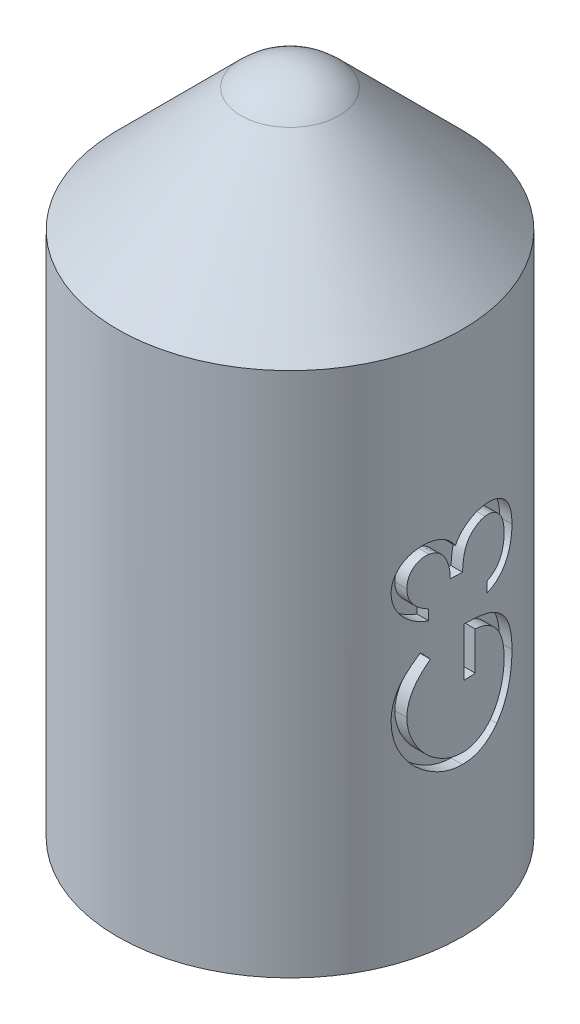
from build123d import *

# Parameters (mm, degrees)
ENL_V_MAT_EXTRU_1_REACH      = 8.874
ENL_V_MAT_EXTRU_1_END_RADIUS = 1.4
ENL_V_MAT_EXTRU_2_REACH      = 8.874
ENL_V_MAT_EXTRU_2_END_RADIUS = 1.4


with BuildPart() as part:
    # Esquisse1 → R_volution1 (revolve)
    with BuildSketch(Plane.XY):
        with BuildLine():
            Line((-1.5, 4.75), (-1.5, 0.17544468))
            ThreePointArc((-1.5, 0.17544468), (-0.755112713, 0.044010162), (0, 0))
            Line((0, 0), (0, 6))
            ThreePointArc((0, 6), (-0.230969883, 5.954057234), (-0.426776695, 5.823223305))
            Line((-0.426776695, 5.823223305), (-1.5, 4.75))
        make_face()
    revolve(axis=Axis((0, 0, 0), (0, 1, 0)))

    # Enl_v. mat.-Extru.1: up to this cylinder (the profile starts outside it)
    enl_v_mat_extru_1_end = Plane(origin=(0, 2.7231785, 0), z_dir=(0, -1, 0)) * Cylinder(ENL_V_MAT_EXTRU_1_END_RADIUS, 22.171931, mode=Mode.PRIVATE)
    # Esquisse2 → Enl_v. mat.-Extru.1 (cut, up to the surface)
    with BuildSketch(Plane(origin=(1.5, 0, 0), x_dir=(0, 0, -1), z_dir=(1, 0, 0)), mode=Mode.PRIVATE) as enl_v_mat_extru_1_sk1:
        with BuildLine():
            Line((-0.329326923, 2.459902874), (-0.256410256, 2.382979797))
            add(Edge.make_bspline(
                [(-0.256410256, 2.382979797), (-0.269509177, 2.369062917), (-0.295394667, 2.341561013), (-0.328926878, 2.296646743), (-0.357936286, 2.249973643), (-0.381363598, 2.201466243), (-0.399741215, 2.152396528), (-0.413100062, 2.103608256), (-0.421560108, 2.055417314), (-0.422576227, 2.02337037), (-0.423076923, 2.007579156)],
                knots=[0, 0, 0, 0, 1.089067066, 2.152164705, 3.18986567, 4.218445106, 5.218487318, 6.173592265, 7.100032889, 8, 8, 8, 8], degree=3))
            add(Edge.make_bspline(
                [(-0.423076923, 2.007579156), (-0.42295875, 1.997889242), (-0.42272271, 1.978534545), (-0.419710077, 1.949785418), (-0.415377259, 1.921337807), (-0.409108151, 1.893245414), (-0.401162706, 1.865453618), (-0.391224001, 1.838059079), (-0.379636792, 1.811010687), (-0.3662475, 1.784563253), (-0.351539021, 1.758923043), (-0.335239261, 1.734707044), (-0.317871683, 1.711759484), (-0.298997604, 1.690516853), (-0.278802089, 1.670837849), (-0.257648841, 1.652360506), (-0.235121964, 1.635429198), (-0.211314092, 1.620347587), (-0.186779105, 1.606728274), (-0.161725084, 1.594959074), (-0.136384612, 1.584727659), (-0.11056688, 1.576935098), (-0.084538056, 1.570334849), (-0.058161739, 1.56574021), (-0.031369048, 1.563141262), (-0.013426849, 1.56269255), (-0.004407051, 1.562466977)],
                knots=[0, 0, 0, 0, 1.028150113, 2.053633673, 3.06513288, 4.081487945, 5.106702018, 6.131327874, 7.172780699, 8.228344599, 9.276313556, 10.308389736, 11.324843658, 12.329040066, 13.321460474, 14.316307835, 15.308626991, 16.309440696, 17.305625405, 18.28535951, 19.246194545, 20.203493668, 21.145557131, 22.095268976, 23.042464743, 24, 24, 24, 24], degree=3))
            add(Edge.make_bspline(
                [(-0.004407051, 1.562466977), (0.004813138, 1.562683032), (0.023228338, 1.563114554), (0.050713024, 1.56587261), (0.077786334, 1.57100267), (0.104490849, 1.577806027), (0.130879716, 1.586455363), (0.156925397, 1.597081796), (0.18262536, 1.609740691), (0.207724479, 1.624361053), (0.232153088, 1.640506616), (0.255356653, 1.658264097), (0.277065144, 1.677663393), (0.297595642, 1.698348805), (0.316818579, 1.720508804), (0.334502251, 1.744358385), (0.350920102, 1.769563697), (0.365891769, 1.796135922), (0.379265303, 1.823794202), (0.391157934, 1.852153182), (0.400952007, 1.881304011), (0.408934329, 1.911093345), (0.415477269, 1.94148571), (0.41968655, 1.972635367), (0.422741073, 2.004313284), (0.422964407, 2.025667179), (0.423076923, 2.03642531)],
                knots=[0, 0, 0, 0, 0.935915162, 1.869274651, 2.799799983, 3.730201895, 4.664668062, 5.616159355, 6.583070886, 7.570012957, 8.562524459, 9.553461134, 10.53281078, 11.515274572, 12.509912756, 13.507571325, 14.526460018, 15.561318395, 16.601025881, 17.643204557, 18.680545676, 19.719612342, 20.772381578, 21.833430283, 22.908478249, 24, 24, 24, 24], degree=3))
            add(Edge.make_bspline(
                [(0.423076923, 2.03642531), (0.422806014, 2.049390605), (0.422274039, 2.074850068), (0.418129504, 2.112274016), (0.411664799, 2.148220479), (0.402167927, 2.182572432), (0.390147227, 2.215454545), (0.375281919, 2.246745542), (0.357728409, 2.276531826), (0.337842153, 2.304684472), (0.315685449, 2.330534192), (0.291989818, 2.3540605), (0.266448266, 2.374454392), (0.239441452, 2.392325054), (0.21071105, 2.407095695), (0.180416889, 2.419223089), (0.148540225, 2.428518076), (0.126514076, 2.432333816), (0.115384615, 2.434261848)],
                knots=[0, 0, 0, 0, 1.130199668, 2.219330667, 3.279027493, 4.311506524, 5.322739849, 6.327972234, 7.327472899, 8.33386792, 9.329086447, 10.29244429, 11.240784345, 12.174119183, 13.111530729, 14.052100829, 15.015757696, 16, 16, 16, 16], degree=3))
            Line((0.115384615, 2.434261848), (0.115384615, 2.100928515))
            Line((0.115384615, 2.100928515), (0.012820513, 2.100928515))
            Line((0.012820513, 2.100928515), (0.012820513, 2.524005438))
            add(Edge.make_bspline(
                [(0.012820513, 2.524005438), (0.031936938, 2.523518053), (0.069351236, 2.522564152), (0.12391417, 2.515873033), (0.17544894, 2.505068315), (0.224009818, 2.490308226), (0.269527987, 2.471201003), (0.312049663, 2.447951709), (0.351300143, 2.420188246), (0.387599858, 2.388899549), (0.419979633, 2.353785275), (0.448438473, 2.315794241), (0.472410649, 2.274863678), (0.491913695, 2.231032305), (0.507134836, 2.18444361), (0.517926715, 2.134989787), (0.524392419, 2.082737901), (0.525218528, 2.046927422), (0.525641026, 2.02861281)],
                knots=[0, 0, 0, 0, 1.140356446, 2.231883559, 3.274166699, 4.278491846, 5.25512956, 6.21435461, 7.1637429, 8.11826594, 9.068280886, 10.0076534, 10.945064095, 11.891975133, 12.864533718, 13.863980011, 14.907571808, 16, 16, 16, 16], degree=3))
            add(Edge.make_bspline(
                [(0.525641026, 2.02861281), (0.52547842, 2.0173242), (0.525157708, 1.995059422), (0.522878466, 1.9621763), (0.51936973, 1.930199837), (0.514071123, 1.899134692), (0.507581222, 1.868866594), (0.499270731, 1.839546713), (0.489651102, 1.811063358), (0.478709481, 1.783372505), (0.466031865, 1.756725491), (0.451943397, 1.731003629), (0.436516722, 1.706064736), (0.419485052, 1.682078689), (0.400975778, 1.658920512), (0.380951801, 1.636739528), (0.359474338, 1.615411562), (0.344223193, 1.60205143), (0.336538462, 1.595319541)],
                knots=[0, 0, 0, 0, 1.107784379, 2.184907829, 3.233506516, 4.263428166, 5.276301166, 6.270063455, 7.25232949, 8.225834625, 9.190232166, 10.146266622, 11.1027726, 12.066435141, 13.031522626, 14.010570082, 14.99756817, 16, 16, 16, 16], degree=3))
            add(Edge.make_bspline(
                [(0.336538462, 1.595319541), (0.324346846, 1.585552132), (0.300165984, 1.566179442), (0.261423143, 1.541242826), (0.221308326, 1.519985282), (0.179709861, 1.502737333), (0.136666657, 1.489269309), (0.092233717, 1.479610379), (0.046353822, 1.473951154), (0.015306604, 1.473135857), (-0.000400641, 1.472723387)],
                knots=[0, 0, 0, 0, 1.023165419, 2.029347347, 3.013907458, 3.994755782, 4.975994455, 5.96558838, 6.970761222, 8, 8, 8, 8], degree=3))
            add(Edge.make_bspline(
                [(-0.000400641, 1.472723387), (-0.012162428, 1.472875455), (-0.035536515, 1.473177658), (-0.070238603, 1.476842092), (-0.104324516, 1.482099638), (-0.137766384, 1.489827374), (-0.170586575, 1.499569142), (-0.202800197, 1.511727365), (-0.234426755, 1.52588273), (-0.265246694, 1.542336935), (-0.294858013, 1.560642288), (-0.323115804, 1.58053019), (-0.349562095, 1.6021541), (-0.374258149, 1.625576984), (-0.397569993, 1.650326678), (-0.419010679, 1.676922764), (-0.438915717, 1.704962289), (-0.456902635, 1.734662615), (-0.473064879, 1.765555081), (-0.487232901, 1.797572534), (-0.498942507, 1.830703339), (-0.508877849, 1.864699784), (-0.516225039, 1.899819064), (-0.52155325, 1.935806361), (-0.525199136, 1.97284925), (-0.525492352, 1.997888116), (-0.525641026, 2.010583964)],
                knots=[0, 0, 0, 0, 1.00895651, 2.005089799, 2.991467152, 3.967318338, 4.948153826, 5.927364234, 6.919980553, 7.91976625, 8.923240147, 9.905815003, 10.88314567, 11.851989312, 12.825009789, 13.798721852, 14.781296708, 15.773896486, 16.776076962, 17.771600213, 18.775744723, 19.78957137, 20.808953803, 21.851964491, 22.910847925, 24, 24, 24, 24], degree=3))
            add(Edge.make_bspline(
                [(-0.525641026, 2.010583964), (-0.525475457, 2.020937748), (-0.525147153, 2.041468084), (-0.522871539, 2.072018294), (-0.519264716, 2.102096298), (-0.514342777, 2.131746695), (-0.507638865, 2.160868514), (-0.499616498, 2.189544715), (-0.490275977, 2.217816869), (-0.479136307, 2.245596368), (-0.466492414, 2.273070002), (-0.452260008, 2.300390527), (-0.436195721, 2.327464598), (-0.418251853, 2.354339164), (-0.398736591, 2.381183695), (-0.377091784, 2.407573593), (-0.354170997, 2.434145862), (-0.337690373, 2.451232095), (-0.329326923, 2.459902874)],
                knots=[0, 0, 0, 0, 0.985871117, 1.954866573, 2.915460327, 3.869826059, 4.81536089, 5.759505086, 6.70452669, 7.649098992, 8.607881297, 9.583363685, 10.581137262, 11.603961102, 12.659522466, 13.73993555, 14.853081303, 16, 16, 16, 16], degree=3))
        make_face()
    enl_v_mat_extru_1_tool1 = extrude(enl_v_mat_extru_1_sk1.sketch, amount=-ENL_V_MAT_EXTRU_1_REACH, mode=Mode.PRIVATE) - enl_v_mat_extru_1_end
    add(enl_v_mat_extru_1_tool1.solids().sort_by_distance((1.5, 2.411213, 0.303659))[0], mode=Mode.SUBTRACT)
    # Esquisse2 → Enl_v. mat.-Extru.1 (cut, up to the surface)
    with BuildSketch(Plane(origin=(1.5, 0, 0), x_dir=(0, 0, -1), z_dir=(1, 0, 0)), mode=Mode.PRIVATE) as enl_v_mat_extru_1_sk2:
        with BuildLine():
            Line((-0.269230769, 2.767595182), (-0.269230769, 2.677851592))
            add(Edge.make_bspline(
                [(-0.269230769, 2.677851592), (-0.279297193, 2.680282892), (-0.298976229, 2.685035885), (-0.327092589, 2.694949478), (-0.353699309, 2.705749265), (-0.378298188, 2.71871758), (-0.401383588, 2.732862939), (-0.42243191, 2.749069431), (-0.441978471, 2.766589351), (-0.459325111, 2.785967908), (-0.475033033, 2.806290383), (-0.488425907, 2.827843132), (-0.499947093, 2.85019253), (-0.509438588, 2.873493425), (-0.516588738, 2.897815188), (-0.521776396, 2.922937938), (-0.525145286, 2.948927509), (-0.525474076, 2.966569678), (-0.525641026, 2.975527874)],
                knots=[0, 0, 0, 0, 1.162005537, 2.271625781, 3.343758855, 4.383309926, 5.390229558, 6.379919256, 7.361854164, 8.333198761, 9.295911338, 10.242430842, 11.177959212, 12.116337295, 13.062827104, 14.020064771, 14.994644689, 16, 16, 16, 16], degree=3))
            add(Edge.make_bspline(
                [(-0.525641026, 2.975527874), (-0.52524696, 2.988580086), (-0.524467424, 3.014399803), (-0.517349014, 3.052332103), (-0.50608469, 3.088911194), (-0.490520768, 3.123736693), (-0.471324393, 3.156084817), (-0.448477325, 3.184866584), (-0.422420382, 3.209691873), (-0.393639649, 3.230518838), (-0.362880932, 3.246825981), (-0.331223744, 3.258850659), (-0.298743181, 3.266171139), (-0.27681253, 3.26711987), (-0.265825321, 3.267595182)],
                knots=[0, 0, 0, 0, 1.083050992, 2.142477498, 3.193116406, 4.255571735, 5.30263384, 6.308962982, 7.297363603, 8.282367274, 9.249857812, 10.179914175, 11.08814088, 12, 12, 12, 12], degree=3))
            add(Edge.make_bspline(
                [(-0.265825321, 3.267595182), (-0.255251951, 3.267262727), (-0.234561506, 3.266612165), (-0.204355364, 3.261088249), (-0.175886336, 3.251792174), (-0.149034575, 3.238915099), (-0.123970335, 3.222246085), (-0.100637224, 3.202053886), (-0.07893175, 3.178195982), (-0.066497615, 3.160116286), (-0.060096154, 3.150808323)],
                knots=[0, 0, 0, 0, 1.024540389, 2.004866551, 2.965041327, 3.920577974, 4.882998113, 5.874504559, 6.905732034, 8, 8, 8, 8], degree=3))
            add(Edge.make_bspline(
                [(-0.060096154, 3.150808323), (-0.054978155, 3.161459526), (-0.044821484, 3.182596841), (-0.02458621, 3.211117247), (-0.001796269, 3.237402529), (0.016187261, 3.251889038), (0.025240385, 3.25918172)],
                knots=[0, 0, 0, 0, 1.015663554, 2.015584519, 3.001021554, 4, 4, 4, 4], degree=3))
            add(Edge.make_bspline(
                [(0.025240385, 3.25918172), (0.031828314, 3.263993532), (0.04489629, 3.27353836), (0.065906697, 3.285319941), (0.08714998, 3.296008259), (0.109195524, 3.304336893), (0.131787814, 3.31078657), (0.154965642, 3.315396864), (0.178747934, 3.318260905), (0.194837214, 3.318671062), (0.202924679, 3.318877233)],
                knots=[0, 0, 0, 0, 1.025084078, 2.033381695, 3.024893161, 4.013698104, 4.991890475, 5.976764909, 6.982997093, 8, 8, 8, 8], degree=3))
            add(Edge.make_bspline(
                [(0.202924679, 3.318877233), (0.216927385, 3.318364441), (0.2448669, 3.31734127), (0.286146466, 3.308198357), (0.326492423, 3.294018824), (0.365101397, 3.273904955), (0.401190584, 3.249280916), (0.433719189, 3.22030965), (0.461241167, 3.18657698), (0.4845151, 3.149305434), (0.502946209, 3.108751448), (0.516230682, 3.065552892), (0.524198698, 3.019959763), (0.525154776, 2.9887809), (0.525641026, 2.972923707)],
                knots=[0, 0, 0, 0, 0.955697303, 1.906897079, 2.875188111, 3.870982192, 4.871999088, 5.854111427, 6.836107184, 7.836239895, 8.848948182, 9.870701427, 10.917064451, 12, 12, 12, 12], degree=3))
            add(Edge.make_bspline(
                [(0.525641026, 2.972923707), (0.525390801, 2.962233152), (0.524898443, 2.941197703), (0.521592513, 2.910261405), (0.515390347, 2.880793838), (0.507590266, 2.852508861), (0.496805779, 2.825833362), (0.483948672, 2.800383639), (0.468689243, 2.776271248), (0.451001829, 2.753639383), (0.431203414, 2.732512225), (0.408965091, 2.713428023), (0.384701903, 2.696175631), (0.358195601, 2.680864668), (0.329520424, 2.667430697), (0.298561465, 2.656162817), (0.265558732, 2.646324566), (0.242566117, 2.6417415), (0.230769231, 2.639390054)],
                knots=[0, 0, 0, 0, 1.048603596, 2.063302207, 3.045874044, 3.999447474, 4.937100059, 5.862643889, 6.7929026, 7.7308982, 8.676022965, 9.627908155, 10.600123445, 11.591992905, 12.626222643, 13.701663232, 14.820785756, 16, 16, 16, 16], degree=3))
            Line((0.230769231, 2.639390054), (0.230769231, 2.729133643))
            add(Edge.make_bspline(
                [(0.230769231, 2.729133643), (0.238468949, 2.731471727), (0.253445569, 2.736019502), (0.274999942, 2.74376073), (0.294759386, 2.752580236), (0.31286885, 2.762041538), (0.329506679, 2.771978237), (0.344232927, 2.783096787), (0.357694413, 2.794573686), (0.365278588, 2.80322493), (0.368990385, 2.807458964)],
                knots=[0, 0, 0, 0, 1.198163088, 2.33053128, 3.407730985, 4.417276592, 5.372219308, 6.28897303, 7.162600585, 8, 8, 8, 8], degree=3))
            add(Edge.make_bspline(
                [(0.368990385, 2.807458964), (0.373305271, 2.813058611), (0.381921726, 2.824240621), (0.392948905, 2.84245073), (0.402387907, 2.861669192), (0.410060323, 2.882056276), (0.415819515, 2.903614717), (0.419964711, 2.926257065), (0.422701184, 2.950020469), (0.42294985, 2.966238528), (0.423076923, 2.974526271)],
                knots=[0, 0, 0, 0, 0.946083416, 1.889246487, 2.84504177, 3.809995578, 4.801312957, 5.829064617, 6.89060985, 8, 8, 8, 8], degree=3))
            add(Edge.make_bspline(
                [(0.423076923, 2.974526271), (0.42290095, 2.983884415), (0.42255685, 3.002183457), (0.419392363, 3.028884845), (0.414783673, 3.054286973), (0.407665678, 3.078107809), (0.398871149, 3.100659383), (0.387828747, 3.121625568), (0.374873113, 3.141281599), (0.360147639, 3.159375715), (0.344027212, 3.17564586), (0.327166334, 3.189971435), (0.309636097, 3.20214991), (0.291339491, 3.211973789), (0.272352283, 3.219731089), (0.252621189, 3.225012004), (0.232307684, 3.228683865), (0.218499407, 3.228982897), (0.211538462, 3.229133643)],
                knots=[0, 0, 0, 0, 1.217147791, 2.380027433, 3.494444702, 4.572153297, 5.609568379, 6.639424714, 7.649109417, 8.668170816, 9.669597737, 10.625200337, 11.543417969, 12.441394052, 13.322311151, 14.205496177, 15.095365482, 16, 16, 16, 16], degree=3))
            add(Edge.make_bspline(
                [(0.211538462, 3.229133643), (0.202221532, 3.228695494), (0.183634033, 3.227821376), (0.156277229, 3.221175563), (0.129909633, 3.21014574), (0.104872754, 3.195007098), (0.081951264, 3.176128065), (0.061353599, 3.154401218), (0.044373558, 3.129235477), (0.032631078, 3.106090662), (0.024620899, 3.085585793), (0.019285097, 3.068038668), (0.01476694, 3.048393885), (0.010563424, 3.026889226), (0.006985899, 3.003362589), (0.004002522, 2.977839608), (0.001615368, 2.950315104), (0.000549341, 2.931260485), (0, 2.921441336)],
                knots=[0, 0, 0, 0, 1.070505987, 2.135685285, 3.216438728, 4.346150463, 5.486482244, 6.621737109, 7.7759408, 8.963942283, 9.59839197, 10.305095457, 11.070459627, 11.915156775, 12.823989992, 13.805807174, 14.869297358, 16, 16, 16, 16], degree=3))
            Line((0, 2.921441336), (-0.102564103, 2.921441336))
            add(Edge.make_bspline(
                [(-0.102564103, 2.921441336), (-0.102804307, 2.933808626), (-0.103274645, 2.95802464), (-0.107821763, 2.993491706), (-0.115121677, 3.027262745), (-0.125551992, 3.05885229), (-0.137837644, 3.08758943), (-0.152033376, 3.112621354), (-0.168100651, 3.133289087), (-0.185731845, 3.149808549), (-0.204538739, 3.162364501), (-0.224260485, 3.171394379), (-0.244975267, 3.176776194), (-0.259117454, 3.177491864), (-0.266225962, 3.177851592)],
                knots=[0, 0, 0, 0, 1.322091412, 2.58874672, 3.817242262, 5.011895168, 6.140903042, 7.155122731, 8.080855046, 8.929742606, 9.727943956, 10.488587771, 11.240295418, 12, 12, 12, 12], degree=3))
            add(Edge.make_bspline(
                [(-0.266225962, 3.177851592), (-0.271449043, 3.17773578), (-0.281840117, 3.177505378), (-0.297068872, 3.174484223), (-0.311831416, 3.170153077), (-0.32595943, 3.163864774), (-0.33948183, 3.155717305), (-0.352546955, 3.145889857), (-0.364985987, 3.134102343), (-0.376863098, 3.120900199), (-0.387667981, 3.106281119), (-0.397124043, 3.090586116), (-0.405145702, 3.07387883), (-0.411782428, 3.056266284), (-0.416769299, 3.037666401), (-0.420351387, 3.018173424), (-0.4225906, 2.997748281), (-0.422913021, 2.983813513), (-0.423076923, 2.976729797)],
                knots=[0, 0, 0, 0, 0.884325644, 1.759323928, 2.622595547, 3.489424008, 4.37295195, 5.294616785, 6.255907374, 7.274251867, 8.302369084, 9.333474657, 10.37669385, 11.44084034, 12.520297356, 13.637342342, 14.798947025, 16, 16, 16, 16], degree=3))
            add(Edge.make_bspline(
                [(-0.423076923, 2.976729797), (-0.422679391, 2.965343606), (-0.421902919, 2.943103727), (-0.415102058, 2.911042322), (-0.404251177, 2.881236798), (-0.391298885, 2.858454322), (-0.378513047, 2.84163073), (-0.367346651, 2.829608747), (-0.354937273, 2.817802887), (-0.340520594, 2.806989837), (-0.32507294, 2.796054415), (-0.307809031, 2.786098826), (-0.289179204, 2.776424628), (-0.276009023, 2.770595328), (-0.269230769, 2.767595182)],
                knots=[0, 0, 0, 0, 1.472543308, 2.876219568, 4.221790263, 5.565193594, 6.249813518, 6.953379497, 7.687249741, 8.463570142, 9.283606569, 10.136032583, 11.040678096, 12, 12, 12, 12], degree=3))
        make_face()
    enl_v_mat_extru_1_tool2 = extrude(enl_v_mat_extru_1_sk2.sketch, amount=-ENL_V_MAT_EXTRU_1_REACH, mode=Mode.PRIVATE) - enl_v_mat_extru_1_end
    add(enl_v_mat_extru_1_tool2.solids().sort_by_distance((1.5, 3.035144, -0.008319))[0], mode=Mode.SUBTRACT)

    # Enl_v. mat.-Extru.2: up to this cylinder (the profile starts outside it)
    enl_v_mat_extru_2_end = Plane(origin=(0, 2.7151985, 0), z_dir=(0, -1, 0)) * Cylinder(ENL_V_MAT_EXTRU_2_END_RADIUS, 22.171931, mode=Mode.PRIVATE)
    # Esquisse3 → Enl_v. mat.-Extru.2 (cut, up to the surface)
    with BuildSketch(Plane.ZY.offset(1.5), mode=Mode.PRIVATE) as enl_v_mat_extru_2_sk1:
        with BuildLine():
            Line((-0.269230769, 2.759615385), (-0.269230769, 2.669871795))
            add(Edge.make_bspline(
                [(-0.269230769, 2.669871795), (-0.279297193, 2.672303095), (-0.298976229, 2.677056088), (-0.327092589, 2.686969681), (-0.353699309, 2.697769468), (-0.378298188, 2.710737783), (-0.401383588, 2.724883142), (-0.42243191, 2.741089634), (-0.441978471, 2.758609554), (-0.459325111, 2.777988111), (-0.475033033, 2.798310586), (-0.488425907, 2.819863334), (-0.499947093, 2.842212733), (-0.509438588, 2.865513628), (-0.516588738, 2.889835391), (-0.521776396, 2.914958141), (-0.525145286, 2.940947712), (-0.525474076, 2.958589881), (-0.525641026, 2.967548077)],
                knots=[0, 0, 0, 0, 1.162005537, 2.271625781, 3.343758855, 4.383309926, 5.390229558, 6.379919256, 7.361854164, 8.333198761, 9.295911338, 10.242430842, 11.177959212, 12.116337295, 13.062827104, 14.020064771, 14.994644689, 16, 16, 16, 16], degree=3))
            add(Edge.make_bspline(
                [(-0.525641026, 2.967548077), (-0.52524696, 2.980600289), (-0.524467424, 3.006420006), (-0.517349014, 3.044352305), (-0.50608469, 3.080931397), (-0.490520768, 3.115756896), (-0.471324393, 3.14810502), (-0.448477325, 3.176886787), (-0.422420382, 3.201712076), (-0.393639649, 3.222539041), (-0.362880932, 3.238846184), (-0.331223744, 3.250870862), (-0.298743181, 3.258191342), (-0.27681253, 3.259140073), (-0.265825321, 3.259615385)],
                knots=[0, 0, 0, 0, 1.083050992, 2.142477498, 3.193116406, 4.255571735, 5.30263384, 6.308962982, 7.297363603, 8.282367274, 9.249857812, 10.179914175, 11.08814088, 12, 12, 12, 12], degree=3))
            add(Edge.make_bspline(
                [(-0.265825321, 3.259615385), (-0.255251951, 3.25928293), (-0.234561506, 3.258632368), (-0.204355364, 3.253108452), (-0.175886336, 3.243812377), (-0.149034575, 3.230935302), (-0.123970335, 3.214266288), (-0.100637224, 3.194074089), (-0.07893175, 3.170216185), (-0.066497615, 3.152136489), (-0.060096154, 3.142828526)],
                knots=[0, 0, 0, 0, 1.024540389, 2.004866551, 2.965041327, 3.920577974, 4.882998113, 5.874504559, 6.905732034, 8, 8, 8, 8], degree=3))
            add(Edge.make_bspline(
                [(-0.060096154, 3.142828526), (-0.054978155, 3.153479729), (-0.044821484, 3.174617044), (-0.02458621, 3.20313745), (-0.001796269, 3.229422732), (0.016187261, 3.243909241), (0.025240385, 3.251201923)],
                knots=[0, 0, 0, 0, 1.015663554, 2.015584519, 3.001021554, 4, 4, 4, 4], degree=3))
            add(Edge.make_bspline(
                [(0.025240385, 3.251201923), (0.031828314, 3.256013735), (0.04489629, 3.265558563), (0.065906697, 3.277340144), (0.08714998, 3.288028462), (0.109195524, 3.296357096), (0.131787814, 3.302806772), (0.154965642, 3.307417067), (0.178747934, 3.310281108), (0.194837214, 3.310691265), (0.202924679, 3.310897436)],
                knots=[0, 0, 0, 0, 1.025084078, 2.033381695, 3.024893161, 4.013698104, 4.991890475, 5.976764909, 6.982997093, 8, 8, 8, 8], degree=3))
            add(Edge.make_bspline(
                [(0.202924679, 3.310897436), (0.216927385, 3.310384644), (0.2448669, 3.309361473), (0.286146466, 3.30021856), (0.326492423, 3.286039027), (0.365101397, 3.265925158), (0.401190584, 3.241301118), (0.433719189, 3.212329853), (0.461241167, 3.178597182), (0.4845151, 3.141325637), (0.502946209, 3.100771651), (0.516230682, 3.057573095), (0.524198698, 3.011979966), (0.525154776, 2.980801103), (0.525641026, 2.96494391)],
                knots=[0, 0, 0, 0, 0.955697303, 1.906897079, 2.875188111, 3.870982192, 4.871999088, 5.854111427, 6.836107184, 7.836239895, 8.848948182, 9.870701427, 10.917064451, 12, 12, 12, 12], degree=3))
            add(Edge.make_bspline(
                [(0.525641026, 2.96494391), (0.525390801, 2.954253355), (0.524898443, 2.933217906), (0.521592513, 2.902281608), (0.515390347, 2.872814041), (0.507590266, 2.844529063), (0.496805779, 2.817853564), (0.483948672, 2.792403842), (0.468689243, 2.768291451), (0.451001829, 2.745659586), (0.431203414, 2.724532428), (0.408965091, 2.705448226), (0.384701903, 2.688195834), (0.358195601, 2.672884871), (0.329520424, 2.659450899), (0.298561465, 2.648183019), (0.265558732, 2.638344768), (0.242566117, 2.633761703), (0.230769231, 2.631410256)],
                knots=[0, 0, 0, 0, 1.048603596, 2.063302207, 3.045874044, 3.999447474, 4.937100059, 5.862643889, 6.7929026, 7.7308982, 8.676022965, 9.627908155, 10.600123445, 11.591992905, 12.626222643, 13.701663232, 14.820785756, 16, 16, 16, 16], degree=3))
            Line((0.230769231, 2.631410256), (0.230769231, 2.721153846))
            add(Edge.make_bspline(
                [(0.230769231, 2.721153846), (0.238468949, 2.723491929), (0.253445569, 2.728039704), (0.274999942, 2.735780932), (0.294759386, 2.744600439), (0.31286885, 2.754061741), (0.329506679, 2.76399844), (0.344232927, 2.77511699), (0.357694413, 2.786593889), (0.365278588, 2.795245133), (0.368990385, 2.799479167)],
                knots=[0, 0, 0, 0, 1.198163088, 2.33053128, 3.407730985, 4.417276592, 5.372219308, 6.28897303, 7.162600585, 8, 8, 8, 8], degree=3))
            add(Edge.make_bspline(
                [(0.368990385, 2.799479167), (0.373305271, 2.805078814), (0.381921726, 2.816260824), (0.392948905, 2.834470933), (0.402387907, 2.853689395), (0.410060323, 2.874076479), (0.415819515, 2.89563492), (0.419964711, 2.918277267), (0.422701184, 2.942040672), (0.42294985, 2.958258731), (0.423076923, 2.966546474)],
                knots=[0, 0, 0, 0, 0.946083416, 1.889246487, 2.84504177, 3.809995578, 4.801312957, 5.829064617, 6.89060985, 8, 8, 8, 8], degree=3))
            add(Edge.make_bspline(
                [(0.423076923, 2.966546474), (0.42290095, 2.975904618), (0.42255685, 2.99420366), (0.419392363, 3.020905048), (0.414783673, 3.046307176), (0.407665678, 3.070128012), (0.398871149, 3.092679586), (0.387828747, 3.113645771), (0.374873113, 3.133301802), (0.360147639, 3.151395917), (0.344027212, 3.167666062), (0.327166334, 3.181991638), (0.309636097, 3.194170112), (0.291339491, 3.203993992), (0.272352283, 3.211751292), (0.252621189, 3.217032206), (0.232307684, 3.220704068), (0.218499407, 3.2210031), (0.211538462, 3.221153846)],
                knots=[0, 0, 0, 0, 1.217147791, 2.380027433, 3.494444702, 4.572153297, 5.609568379, 6.639424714, 7.649109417, 8.668170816, 9.669597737, 10.625200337, 11.543417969, 12.441394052, 13.322311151, 14.205496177, 15.095365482, 16, 16, 16, 16], degree=3))
            add(Edge.make_bspline(
                [(0.211538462, 3.221153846), (0.202221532, 3.220715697), (0.183634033, 3.219841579), (0.156277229, 3.213195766), (0.129909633, 3.202165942), (0.104872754, 3.187027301), (0.081951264, 3.168148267), (0.061353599, 3.146421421), (0.044373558, 3.121255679), (0.032631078, 3.098110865), (0.024620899, 3.077605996), (0.019285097, 3.06005887), (0.01476694, 3.040414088), (0.010563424, 3.018909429), (0.006985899, 2.995382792), (0.004002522, 2.969859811), (0.001615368, 2.942335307), (0.000549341, 2.923280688), (0, 2.913461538)],
                knots=[0, 0, 0, 0, 1.070505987, 2.135685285, 3.216438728, 4.346150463, 5.486482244, 6.621737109, 7.7759408, 8.963942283, 9.59839197, 10.305095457, 11.070459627, 11.915156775, 12.823989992, 13.805807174, 14.869297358, 16, 16, 16, 16], degree=3))
            Line((0, 2.913461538), (-0.102564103, 2.913461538))
            add(Edge.make_bspline(
                [(-0.102564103, 2.913461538), (-0.102804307, 2.925828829), (-0.103274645, 2.950044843), (-0.107821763, 2.985511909), (-0.115121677, 3.019282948), (-0.125551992, 3.050872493), (-0.137837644, 3.079609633), (-0.152033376, 3.104641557), (-0.168100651, 3.125309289), (-0.185731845, 3.141828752), (-0.204538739, 3.154384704), (-0.224260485, 3.163414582), (-0.244975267, 3.168796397), (-0.259117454, 3.169512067), (-0.266225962, 3.169871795)],
                knots=[0, 0, 0, 0, 1.322091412, 2.58874672, 3.817242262, 5.011895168, 6.140903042, 7.155122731, 8.080855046, 8.929742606, 9.727943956, 10.488587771, 11.240295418, 12, 12, 12, 12], degree=3))
            add(Edge.make_bspline(
                [(-0.266225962, 3.169871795), (-0.271449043, 3.169755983), (-0.281840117, 3.169525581), (-0.297068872, 3.166504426), (-0.311831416, 3.16217328), (-0.32595943, 3.155884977), (-0.33948183, 3.147737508), (-0.352546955, 3.13791006), (-0.364985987, 3.126122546), (-0.376863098, 3.112920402), (-0.387667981, 3.098301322), (-0.397124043, 3.082606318), (-0.405145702, 3.065899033), (-0.411782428, 3.048286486), (-0.416769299, 3.029686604), (-0.420351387, 3.010193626), (-0.4225906, 2.989768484), (-0.422913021, 2.975833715), (-0.423076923, 2.96875)],
                knots=[0, 0, 0, 0, 0.884325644, 1.759323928, 2.622595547, 3.489424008, 4.37295195, 5.294616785, 6.255907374, 7.274251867, 8.302369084, 9.333474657, 10.37669385, 11.44084034, 12.520297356, 13.637342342, 14.798947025, 16, 16, 16, 16], degree=3))
            add(Edge.make_bspline(
                [(-0.423076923, 2.96875), (-0.422679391, 2.957363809), (-0.421902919, 2.93512393), (-0.415102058, 2.903062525), (-0.404251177, 2.873257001), (-0.391298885, 2.850474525), (-0.378513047, 2.833650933), (-0.367346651, 2.82162895), (-0.354937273, 2.80982309), (-0.340520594, 2.79901004), (-0.32507294, 2.788074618), (-0.307809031, 2.778119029), (-0.289179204, 2.768444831), (-0.276009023, 2.762615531), (-0.269230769, 2.759615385)],
                knots=[0, 0, 0, 0, 1.472543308, 2.876219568, 4.221790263, 5.565193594, 6.249813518, 6.953379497, 7.687249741, 8.463570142, 9.283606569, 10.136032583, 11.040678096, 12, 12, 12, 12], degree=3))
        make_face()
    enl_v_mat_extru_2_tool1 = extrude(enl_v_mat_extru_2_sk1.sketch, amount=-ENL_V_MAT_EXTRU_2_REACH, mode=Mode.PRIVATE) - enl_v_mat_extru_2_end
    add(enl_v_mat_extru_2_tool1.solids().sort_by_distance((-1.5, 3.027164, 0.008319))[0], mode=Mode.SUBTRACT)
    # Esquisse3 → Enl_v. mat.-Extru.2 (cut, up to the surface)
    with BuildSketch(Plane.ZY.offset(1.5), mode=Mode.PRIVATE) as enl_v_mat_extru_2_sk2:
        with BuildLine():
            Line((-0.329326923, 2.451923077), (-0.256410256, 2.375))
            add(Edge.make_bspline(
                [(-0.256410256, 2.375), (-0.269509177, 2.36108312), (-0.295394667, 2.333581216), (-0.328926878, 2.288666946), (-0.357936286, 2.241993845), (-0.381363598, 2.193486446), (-0.399741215, 2.144416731), (-0.413100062, 2.095628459), (-0.421560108, 2.047437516), (-0.422576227, 2.015390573), (-0.423076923, 1.999599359)],
                knots=[0, 0, 0, 0, 1.089067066, 2.152164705, 3.18986567, 4.218445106, 5.218487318, 6.173592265, 7.100032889, 8, 8, 8, 8], degree=3))
            add(Edge.make_bspline(
                [(-0.423076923, 1.999599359), (-0.42295875, 1.989909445), (-0.42272271, 1.970554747), (-0.419710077, 1.941805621), (-0.415377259, 1.91335801), (-0.409108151, 1.885265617), (-0.401162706, 1.857473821), (-0.391224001, 1.830079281), (-0.379636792, 1.80303089), (-0.3662475, 1.776583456), (-0.351539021, 1.750943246), (-0.335239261, 1.726727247), (-0.317871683, 1.703779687), (-0.298997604, 1.682537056), (-0.278802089, 1.662858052), (-0.257648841, 1.644380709), (-0.235121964, 1.627449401), (-0.211314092, 1.61236779), (-0.186779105, 1.598748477), (-0.161725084, 1.586979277), (-0.136384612, 1.576747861), (-0.11056688, 1.568955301), (-0.084538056, 1.562355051), (-0.058161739, 1.557760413), (-0.031369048, 1.555161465), (-0.013426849, 1.554712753), (-0.004407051, 1.554487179)],
                knots=[0, 0, 0, 0, 1.028150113, 2.053633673, 3.06513288, 4.081487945, 5.106702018, 6.131327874, 7.172780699, 8.228344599, 9.276313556, 10.308389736, 11.324843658, 12.329040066, 13.321460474, 14.316307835, 15.308626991, 16.309440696, 17.305625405, 18.28535951, 19.246194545, 20.203493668, 21.145557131, 22.095268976, 23.042464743, 24, 24, 24, 24], degree=3))
            add(Edge.make_bspline(
                [(-0.004407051, 1.554487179), (0.004813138, 1.554703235), (0.023228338, 1.555134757), (0.050713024, 1.557892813), (0.077786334, 1.563022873), (0.104490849, 1.56982623), (0.130879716, 1.578475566), (0.156925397, 1.589101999), (0.18262536, 1.601760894), (0.207724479, 1.616381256), (0.232153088, 1.632526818), (0.255356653, 1.6502843), (0.277065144, 1.669683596), (0.297595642, 1.690369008), (0.316818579, 1.712529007), (0.334502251, 1.736378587), (0.350920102, 1.7615839), (0.365891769, 1.788156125), (0.379265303, 1.815814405), (0.391157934, 1.844173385), (0.400952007, 1.873324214), (0.408934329, 1.903113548), (0.415477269, 1.933505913), (0.41968655, 1.96465557), (0.422741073, 1.996333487), (0.422964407, 2.017687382), (0.423076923, 2.028445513)],
                knots=[0, 0, 0, 0, 0.935915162, 1.869274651, 2.799799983, 3.730201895, 4.664668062, 5.616159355, 6.583070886, 7.570012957, 8.562524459, 9.553461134, 10.53281078, 11.515274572, 12.509912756, 13.507571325, 14.526460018, 15.561318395, 16.601025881, 17.643204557, 18.680545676, 19.719612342, 20.772381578, 21.833430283, 22.908478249, 24, 24, 24, 24], degree=3))
            add(Edge.make_bspline(
                [(0.423076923, 2.028445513), (0.422806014, 2.041410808), (0.422274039, 2.066870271), (0.418129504, 2.104294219), (0.411664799, 2.140240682), (0.402167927, 2.174592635), (0.390147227, 2.207474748), (0.375281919, 2.238765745), (0.357728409, 2.268552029), (0.337842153, 2.296704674), (0.315685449, 2.322554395), (0.291989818, 2.346080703), (0.266448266, 2.366474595), (0.239441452, 2.384345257), (0.21071105, 2.399115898), (0.180416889, 2.411243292), (0.148540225, 2.420538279), (0.126514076, 2.424354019), (0.115384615, 2.426282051)],
                knots=[0, 0, 0, 0, 1.130199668, 2.219330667, 3.279027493, 4.311506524, 5.322739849, 6.327972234, 7.327472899, 8.33386792, 9.329086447, 10.29244429, 11.240784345, 12.174119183, 13.111530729, 14.052100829, 15.015757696, 16, 16, 16, 16], degree=3))
            Line((0.115384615, 2.426282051), (0.115384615, 2.092948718))
            Line((0.115384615, 2.092948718), (0.012820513, 2.092948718))
            Line((0.012820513, 2.092948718), (0.012820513, 2.516025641))
            add(Edge.make_bspline(
                [(0.012820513, 2.516025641), (0.031936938, 2.515538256), (0.069351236, 2.514584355), (0.12391417, 2.507893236), (0.17544894, 2.497088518), (0.224009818, 2.482328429), (0.269527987, 2.463221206), (0.312049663, 2.439971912), (0.351300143, 2.412208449), (0.387599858, 2.380919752), (0.419979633, 2.345805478), (0.448438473, 2.307814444), (0.472410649, 2.266883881), (0.491913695, 2.223052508), (0.507134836, 2.176463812), (0.517926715, 2.12700999), (0.524392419, 2.074758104), (0.525218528, 2.038947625), (0.525641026, 2.020633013)],
                knots=[0, 0, 0, 0, 1.140356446, 2.231883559, 3.274166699, 4.278491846, 5.25512956, 6.21435461, 7.1637429, 8.11826594, 9.068280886, 10.0076534, 10.945064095, 11.891975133, 12.864533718, 13.863980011, 14.907571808, 16, 16, 16, 16], degree=3))
            add(Edge.make_bspline(
                [(0.525641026, 2.020633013), (0.52547842, 2.009344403), (0.525157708, 1.987079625), (0.522878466, 1.954196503), (0.51936973, 1.92222004), (0.514071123, 1.891154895), (0.507581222, 1.860886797), (0.499270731, 1.831566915), (0.489651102, 1.803083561), (0.478709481, 1.775392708), (0.466031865, 1.748745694), (0.451943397, 1.723023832), (0.436516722, 1.698084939), (0.419485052, 1.674098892), (0.400975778, 1.650940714), (0.380951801, 1.628759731), (0.359474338, 1.607431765), (0.344223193, 1.594071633), (0.336538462, 1.587339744)],
                knots=[0, 0, 0, 0, 1.107784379, 2.184907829, 3.233506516, 4.263428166, 5.276301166, 6.270063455, 7.25232949, 8.225834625, 9.190232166, 10.146266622, 11.1027726, 12.066435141, 13.031522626, 14.010570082, 14.99756817, 16, 16, 16, 16], degree=3))
            add(Edge.make_bspline(
                [(0.336538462, 1.587339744), (0.324346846, 1.577572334), (0.300165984, 1.558199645), (0.261423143, 1.533263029), (0.221308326, 1.512005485), (0.179709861, 1.494757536), (0.136666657, 1.481289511), (0.092233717, 1.471630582), (0.046353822, 1.465971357), (0.015306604, 1.46515606), (-0.000400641, 1.46474359)],
                knots=[0, 0, 0, 0, 1.023165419, 2.029347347, 3.013907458, 3.994755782, 4.975994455, 5.96558838, 6.970761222, 8, 8, 8, 8], degree=3))
            add(Edge.make_bspline(
                [(-0.000400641, 1.46474359), (-0.012162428, 1.464895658), (-0.035536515, 1.465197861), (-0.070238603, 1.468862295), (-0.104324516, 1.474119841), (-0.137766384, 1.481847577), (-0.170586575, 1.491589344), (-0.202800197, 1.503747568), (-0.234426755, 1.517902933), (-0.265246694, 1.534357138), (-0.294858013, 1.552662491), (-0.323115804, 1.572550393), (-0.349562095, 1.594174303), (-0.374258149, 1.617597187), (-0.397569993, 1.642346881), (-0.419010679, 1.668942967), (-0.438915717, 1.696982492), (-0.456902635, 1.726682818), (-0.473064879, 1.757575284), (-0.487232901, 1.789592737), (-0.498942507, 1.822723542), (-0.508877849, 1.856719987), (-0.516225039, 1.891839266), (-0.52155325, 1.927826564), (-0.525199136, 1.964869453), (-0.525492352, 1.989908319), (-0.525641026, 2.002604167)],
                knots=[0, 0, 0, 0, 1.00895651, 2.005089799, 2.991467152, 3.967318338, 4.948153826, 5.927364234, 6.919980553, 7.91976625, 8.923240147, 9.905815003, 10.88314567, 11.851989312, 12.825009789, 13.798721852, 14.781296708, 15.773896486, 16.776076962, 17.771600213, 18.775744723, 19.78957137, 20.808953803, 21.851964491, 22.910847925, 24, 24, 24, 24], degree=3))
            add(Edge.make_bspline(
                [(-0.525641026, 2.002604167), (-0.525475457, 2.012957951), (-0.525147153, 2.033488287), (-0.522871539, 2.064038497), (-0.519264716, 2.094116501), (-0.514342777, 2.123766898), (-0.507638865, 2.152888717), (-0.499616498, 2.181564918), (-0.490275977, 2.209837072), (-0.479136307, 2.237616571), (-0.466492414, 2.265090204), (-0.452260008, 2.29241073), (-0.436195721, 2.319484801), (-0.418251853, 2.346359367), (-0.398736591, 2.373203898), (-0.377091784, 2.399593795), (-0.354170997, 2.426166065), (-0.337690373, 2.443252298), (-0.329326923, 2.451923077)],
                knots=[0, 0, 0, 0, 0.985871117, 1.954866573, 2.915460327, 3.869826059, 4.81536089, 5.759505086, 6.70452669, 7.649098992, 8.607881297, 9.583363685, 10.581137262, 11.603961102, 12.659522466, 13.73993555, 14.853081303, 16, 16, 16, 16], degree=3))
        make_face()
    enl_v_mat_extru_2_tool2 = extrude(enl_v_mat_extru_2_sk2.sketch, amount=-ENL_V_MAT_EXTRU_2_REACH, mode=Mode.PRIVATE) - enl_v_mat_extru_2_end
    add(enl_v_mat_extru_2_tool2.solids().sort_by_distance((-1.5, 2.403233, -0.303659))[0], mode=Mode.SUBTRACT)


solid = part.part
